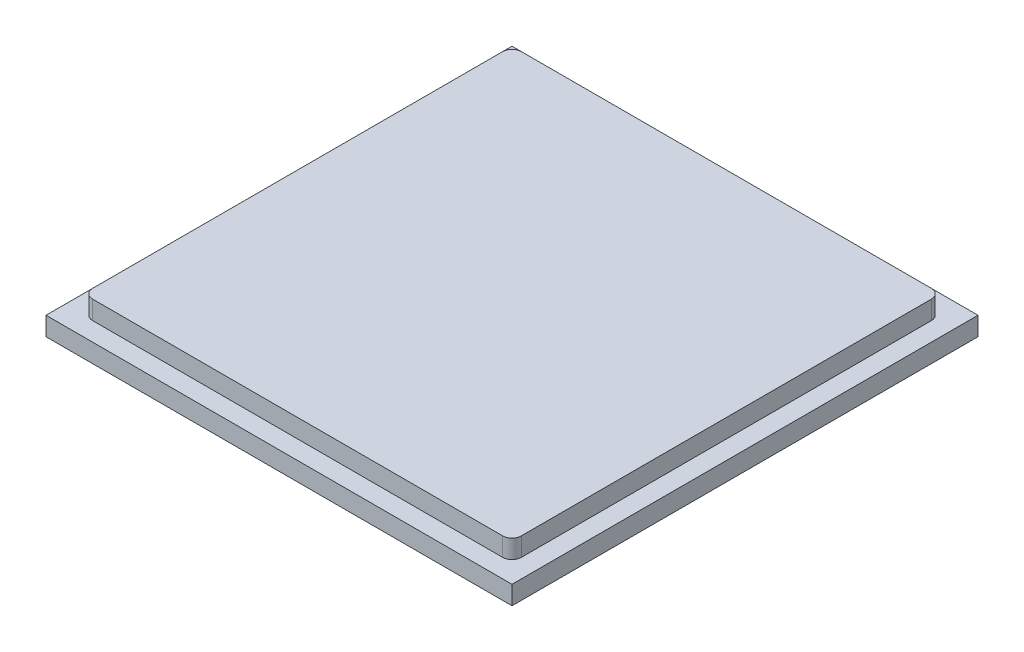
ISO-10303-21;
HEADER;
FILE_DESCRIPTION(('STEP AP214'),'2;1');
FILE_NAME('part.step','',(''),(''),'','','');
FILE_SCHEMA(('AUTOMOTIVE_DESIGN { 1 0 10303 214 1 1 1 1 }'));
ENDSEC;
DATA;
#1=APPLICATION_CONTEXT('core data for automotive mechanical design processes');
#2=APPLICATION_PROTOCOL_DEFINITION('international standard','automotive_design',2000,#1);
#3=PRODUCT_CONTEXT('',#1,'mechanical');
#4=PRODUCT('Part','Part','',(#3));
#5=PRODUCT_RELATED_PRODUCT_CATEGORY('part','',(#4));
#6=PRODUCT_DEFINITION_FORMATION('','',#4);
#7=PRODUCT_DEFINITION_CONTEXT('part definition',#1,'design');
#8=PRODUCT_DEFINITION('design','',#6,#7);
#9=PRODUCT_DEFINITION_SHAPE('','',#8);
#10=(LENGTH_UNIT() NAMED_UNIT(*) SI_UNIT(.MILLI.,.METRE.));
#11=(NAMED_UNIT(*) PLANE_ANGLE_UNIT() SI_UNIT($,.RADIAN.));
#12=(NAMED_UNIT(*) SI_UNIT($,.STERADIAN.) SOLID_ANGLE_UNIT());
#13=UNCERTAINTY_MEASURE_WITH_UNIT(LENGTH_MEASURE(1.E-05),#10,'distance_accuracy_value','');
#14=(GEOMETRIC_REPRESENTATION_CONTEXT(3) GLOBAL_UNCERTAINTY_ASSIGNED_CONTEXT((#13)) GLOBAL_UNIT_ASSIGNED_CONTEXT((#10,
#11,#12)) REPRESENTATION_CONTEXT('',''));
#15=CARTESIAN_POINT('',(0.,0.,0.));
#16=DIRECTION('',(0.,0.,1.));
#17=DIRECTION('',(1.,0.,0.));
#18=AXIS2_PLACEMENT_3D('',#15,#16,#17);
#19=CARTESIAN_POINT('',(0.,2.54,0.));
#20=DIRECTION('',(1.,0.,0.));
#21=DIRECTION('',(0.,0.,-1.));
#22=AXIS2_PLACEMENT_3D('',#19,#20,#21);
#23=PLANE('',#22);
#24=DIRECTION('',(0.,0.,1.));
#25=VECTOR('',#24,1.);
#26=CARTESIAN_POINT('',(0.,0.,0.));
#27=LINE('',#26,#25);
#28=CARTESIAN_POINT('',(0.,0.,-63.5));
#29=VERTEX_POINT('',#28);
#30=CARTESIAN_POINT('',(0.,0.,0.));
#31=VERTEX_POINT('',#30);
#32=EDGE_CURVE('E151',#29,#31,#27,.T.);
#33=ORIENTED_EDGE('',*,*,#32,.T.);
#34=DIRECTION('',(0.,-1.,0.));
#35=VECTOR('',#34,1.);
#36=CARTESIAN_POINT('',(0.,2.54,0.));
#37=LINE('',#36,#35);
#38=CARTESIAN_POINT('',(0.,2.54,0.));
#39=VERTEX_POINT('',#38);
#40=EDGE_CURVE('E11',#39,#31,#37,.T.);
#41=ORIENTED_EDGE('',*,*,#40,.F.);
#42=DIRECTION('',(0.,0.,1.));
#43=VECTOR('',#42,1.);
#44=CARTESIAN_POINT('',(0.,2.54,0.));
#45=LINE('',#44,#43);
#46=CARTESIAN_POINT('',(0.,2.54,-63.5));
#47=VERTEX_POINT('',#46);
#48=EDGE_CURVE('E236',#47,#39,#45,.T.);
#49=ORIENTED_EDGE('',*,*,#48,.F.);
#50=DIRECTION('',(0.,-1.,0.));
#51=VECTOR('',#50,1.);
#52=CARTESIAN_POINT('',(0.,2.54,-63.5));
#53=LINE('',#52,#51);
#54=EDGE_CURVE('E246',#47,#29,#53,.T.);
#55=ORIENTED_EDGE('',*,*,#54,.T.);
#56=EDGE_LOOP('',(#33,#41,#49,#55));
#57=FACE_BOUND('',#56,.T.);
#58=ADVANCED_FACE('F45',(#57),#23,.F.);
#59=CARTESIAN_POINT('',(0.,2.54,0.));
#60=DIRECTION('',(0.,0.,-1.));
#61=DIRECTION('',(-1.,0.,0.));
#62=AXIS2_PLACEMENT_3D('',#59,#60,#61);
#63=PLANE('',#62);
#64=DIRECTION('',(1.,0.,0.));
#65=VECTOR('',#64,1.);
#66=CARTESIAN_POINT('',(0.,0.,0.));
#67=LINE('',#66,#65);
#68=CARTESIAN_POINT('',(63.5,0.,0.));
#69=VERTEX_POINT('',#68);
#70=EDGE_CURVE('E250',#31,#69,#67,.T.);
#71=ORIENTED_EDGE('',*,*,#70,.T.);
#72=DIRECTION('',(0.,-1.,0.));
#73=VECTOR('',#72,1.);
#74=CARTESIAN_POINT('',(63.5,2.54,0.));
#75=LINE('',#74,#73);
#76=CARTESIAN_POINT('',(63.5,2.54,0.));
#77=VERTEX_POINT('',#76);
#78=EDGE_CURVE('E53',#77,#69,#75,.T.);
#79=ORIENTED_EDGE('',*,*,#78,.F.);
#80=DIRECTION('',(1.,0.,0.));
#81=VECTOR('',#80,1.);
#82=CARTESIAN_POINT('',(0.,2.54,0.));
#83=LINE('',#82,#81);
#84=EDGE_CURVE('E97',#39,#77,#83,.T.);
#85=ORIENTED_EDGE('',*,*,#84,.F.);
#86=ORIENTED_EDGE('',*,*,#40,.T.);
#87=EDGE_LOOP('',(#71,#79,#85,#86));
#88=FACE_BOUND('',#87,.T.);
#89=ADVANCED_FACE('F285',(#88),#63,.F.);
#90=CARTESIAN_POINT('',(63.5,2.54,0.));
#91=DIRECTION('',(-1.,0.,0.));
#92=DIRECTION('',(0.,0.,1.));
#93=AXIS2_PLACEMENT_3D('',#90,#91,#92);
#94=PLANE('',#93);
#95=DIRECTION('',(0.,0.,-1.));
#96=VECTOR('',#95,1.);
#97=CARTESIAN_POINT('',(63.5,0.,0.));
#98=LINE('',#97,#96);
#99=CARTESIAN_POINT('',(63.5,0.,-63.5));
#100=VERTEX_POINT('',#99);
#101=EDGE_CURVE('E253',#69,#100,#98,.T.);
#102=ORIENTED_EDGE('',*,*,#101,.T.);
#103=DIRECTION('',(0.,-1.,0.));
#104=VECTOR('',#103,1.);
#105=CARTESIAN_POINT('',(63.5,2.54,-63.5));
#106=LINE('',#105,#104);
#107=CARTESIAN_POINT('',(63.5,2.54,-63.5));
#108=VERTEX_POINT('',#107);
#109=EDGE_CURVE('E260',#108,#100,#106,.T.);
#110=ORIENTED_EDGE('',*,*,#109,.F.);
#111=DIRECTION('',(0.,0.,-1.));
#112=VECTOR('',#111,1.);
#113=CARTESIAN_POINT('',(63.5,2.54,0.));
#114=LINE('',#113,#112);
#115=EDGE_CURVE('E241',#77,#108,#114,.T.);
#116=ORIENTED_EDGE('',*,*,#115,.F.);
#117=ORIENTED_EDGE('',*,*,#78,.T.);
#118=EDGE_LOOP('',(#102,#110,#116,#117));
#119=FACE_BOUND('',#118,.T.);
#120=ADVANCED_FACE('F267',(#119),#94,.F.);
#121=CARTESIAN_POINT('',(0.,2.54,-63.5));
#122=DIRECTION('',(0.,0.,1.));
#123=DIRECTION('',(1.,0.,0.));
#124=AXIS2_PLACEMENT_3D('',#121,#122,#123);
#125=PLANE('',#124);
#126=DIRECTION('',(-1.,0.,0.));
#127=VECTOR('',#126,1.);
#128=CARTESIAN_POINT('',(0.,0.,-63.5));
#129=LINE('',#128,#127);
#130=EDGE_CURVE('E90',#100,#29,#129,.T.);
#131=ORIENTED_EDGE('',*,*,#130,.T.);
#132=ORIENTED_EDGE('',*,*,#54,.F.);
#133=DIRECTION('',(-1.,0.,0.));
#134=VECTOR('',#133,1.);
#135=CARTESIAN_POINT('',(0.,2.54,-63.5));
#136=LINE('',#135,#134);
#137=EDGE_CURVE('E69',#108,#47,#136,.T.);
#138=ORIENTED_EDGE('',*,*,#137,.F.);
#139=ORIENTED_EDGE('',*,*,#109,.T.);
#140=EDGE_LOOP('',(#131,#132,#138,#139));
#141=FACE_BOUND('',#140,.T.);
#142=ADVANCED_FACE('F275',(#141),#125,.F.);
#143=CARTESIAN_POINT('',(0.,2.54,0.));
#144=DIRECTION('',(0.,-1.,0.));
#145=DIRECTION('',(0.,0.,-1.));
#146=AXIS2_PLACEMENT_3D('',#143,#144,#145);
#147=PLANE('',#146);
#148=DIRECTION('',(0.,0.,-1.));
#149=VECTOR('',#148,1.);
#150=CARTESIAN_POINT('',(2.54,2.54,0.));
#151=LINE('',#150,#149);
#152=CARTESIAN_POINT('',(2.54,2.54,-3.81000000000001));
#153=VERTEX_POINT('',#152);
#154=CARTESIAN_POINT('',(2.54,2.54,-59.69));
#155=VERTEX_POINT('',#154);
#156=EDGE_CURVE('E191',#153,#155,#151,.T.);
#157=ORIENTED_EDGE('',*,*,#156,.T.);
#158=CARTESIAN_POINT('',(3.81,2.54,-59.69));
#159=DIRECTION('',(0.,1.,0.));
#160=DIRECTION('',(0.,0.,1.));
#161=AXIS2_PLACEMENT_3D('',#158,#159,#160);
#162=CIRCLE('',#161,1.27);
#163=CARTESIAN_POINT('',(3.81000000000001,2.54,-60.96));
#164=VERTEX_POINT('',#163);
#165=EDGE_CURVE('E60',#155,#164,#162,.F.);
#166=ORIENTED_EDGE('',*,*,#165,.T.);
#167=DIRECTION('',(1.,0.,0.));
#168=VECTOR('',#167,1.);
#169=CARTESIAN_POINT('',(0.,2.54,-60.96));
#170=LINE('',#169,#168);
#171=CARTESIAN_POINT('',(59.69,2.54,-60.96));
#172=VERTEX_POINT('',#171);
#173=EDGE_CURVE('E164',#164,#172,#170,.T.);
#174=ORIENTED_EDGE('',*,*,#173,.T.);
#175=CARTESIAN_POINT('',(59.69,2.54,-59.69));
#176=DIRECTION('',(0.,1.,0.));
#177=DIRECTION('',(0.,0.,1.));
#178=AXIS2_PLACEMENT_3D('',#175,#176,#177);
#179=CIRCLE('',#178,1.27);
#180=CARTESIAN_POINT('',(60.96,2.54,-59.69));
#181=VERTEX_POINT('',#180);
#182=EDGE_CURVE('E208',#172,#181,#179,.F.);
#183=ORIENTED_EDGE('',*,*,#182,.T.);
#184=DIRECTION('',(0.,0.,-1.));
#185=VECTOR('',#184,1.);
#186=CARTESIAN_POINT('',(60.96,2.54,0.));
#187=LINE('',#186,#185);
#188=CARTESIAN_POINT('',(60.96,2.54,-3.81000000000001));
#189=VERTEX_POINT('',#188);
#190=EDGE_CURVE('E204',#189,#181,#187,.T.);
#191=ORIENTED_EDGE('',*,*,#190,.F.);
#192=CARTESIAN_POINT('',(59.69,2.54,-3.81));
#193=DIRECTION('',(0.,1.,0.));
#194=DIRECTION('',(0.,0.,1.));
#195=AXIS2_PLACEMENT_3D('',#192,#193,#194);
#196=CIRCLE('',#195,1.27);
#197=CARTESIAN_POINT('',(59.69,2.54,-2.54));
#198=VERTEX_POINT('',#197);
#199=EDGE_CURVE('E201',#198,#189,#196,.T.);
#200=ORIENTED_EDGE('',*,*,#199,.F.);
#201=DIRECTION('',(1.,0.,0.));
#202=VECTOR('',#201,1.);
#203=CARTESIAN_POINT('',(0.,2.54,-2.54));
#204=LINE('',#203,#202);
#205=CARTESIAN_POINT('',(3.81000000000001,2.54,-2.54));
#206=VERTEX_POINT('',#205);
#207=EDGE_CURVE('E198',#206,#198,#204,.T.);
#208=ORIENTED_EDGE('',*,*,#207,.F.);
#209=CARTESIAN_POINT('',(3.81,2.54,-3.81));
#210=DIRECTION('',(0.,1.,0.));
#211=DIRECTION('',(0.,0.,1.));
#212=AXIS2_PLACEMENT_3D('',#209,#210,#211);
#213=CIRCLE('',#212,1.27);
#214=EDGE_CURVE('E194',#206,#153,#213,.F.);
#215=ORIENTED_EDGE('',*,*,#214,.T.);
#216=EDGE_LOOP('',(#157,#166,#174,#183,#191,#200,#208,#215));
#217=FACE_BOUND('',#216,.T.);
#218=ORIENTED_EDGE('',*,*,#48,.T.);
#219=ORIENTED_EDGE('',*,*,#84,.T.);
#220=ORIENTED_EDGE('',*,*,#115,.T.);
#221=ORIENTED_EDGE('',*,*,#137,.T.);
#222=EDGE_LOOP('',(#218,#219,#220,#221));
#223=FACE_BOUND('',#222,.T.);
#224=ADVANCED_FACE('F277',(#217,#223),#147,.F.);
#225=CARTESIAN_POINT('',(0.,0.,0.));
#226=DIRECTION('',(0.,-1.,0.));
#227=DIRECTION('',(0.,0.,-1.));
#228=AXIS2_PLACEMENT_3D('',#225,#226,#227);
#229=PLANE('',#228);
#230=ORIENTED_EDGE('',*,*,#32,.F.);
#231=ORIENTED_EDGE('',*,*,#130,.F.);
#232=ORIENTED_EDGE('',*,*,#101,.F.);
#233=ORIENTED_EDGE('',*,*,#70,.F.);
#234=EDGE_LOOP('',(#230,#231,#232,#233));
#235=FACE_BOUND('',#234,.T.);
#236=ADVANCED_FACE('F271',(#235),#229,.T.);
#237=CARTESIAN_POINT('',(3.81,5.08,-59.69));
#238=DIRECTION('',(0.,-1.,0.));
#239=DIRECTION('',(0.,0.,-1.));
#240=AXIS2_PLACEMENT_3D('',#237,#238,#239);
#241=CYLINDRICAL_SURFACE('',#240,1.27);
#242=ORIENTED_EDGE('',*,*,#165,.F.);
#243=DIRECTION('',(0.,-1.,0.));
#244=VECTOR('',#243,1.);
#245=CARTESIAN_POINT('',(2.54,5.08,-59.69));
#246=LINE('',#245,#244);
#247=CARTESIAN_POINT('',(2.54,5.08,-59.69));
#248=VERTEX_POINT('',#247);
#249=EDGE_CURVE('E141',#248,#155,#246,.T.);
#250=ORIENTED_EDGE('',*,*,#249,.F.);
#251=CARTESIAN_POINT('',(3.81,5.08,-59.69));
#252=DIRECTION('',(0.,1.,0.));
#253=DIRECTION('',(0.,0.,1.));
#254=AXIS2_PLACEMENT_3D('',#251,#252,#253);
#255=CIRCLE('',#254,1.27);
#256=CARTESIAN_POINT('',(3.81000000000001,5.08,-60.96));
#257=VERTEX_POINT('',#256);
#258=EDGE_CURVE('E144',#248,#257,#255,.F.);
#259=ORIENTED_EDGE('',*,*,#258,.T.);
#260=DIRECTION('',(0.,-1.,0.));
#261=VECTOR('',#260,1.);
#262=CARTESIAN_POINT('',(3.81000000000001,5.08,-60.96));
#263=LINE('',#262,#261);
#264=EDGE_CURVE('E188',#257,#164,#263,.T.);
#265=ORIENTED_EDGE('',*,*,#264,.T.);
#266=EDGE_LOOP('',(#242,#250,#259,#265));
#267=FACE_BOUND('',#266,.T.);
#268=ADVANCED_FACE('F143',(#267),#241,.T.);
#269=CARTESIAN_POINT('',(2.54,5.08,0.));
#270=DIRECTION('',(-1.,0.,0.));
#271=DIRECTION('',(0.,0.,1.));
#272=AXIS2_PLACEMENT_3D('',#269,#270,#271);
#273=PLANE('',#272);
#274=ORIENTED_EDGE('',*,*,#156,.F.);
#275=DIRECTION('',(0.,-1.,0.));
#276=VECTOR('',#275,1.);
#277=CARTESIAN_POINT('',(2.54,5.08,-3.81000000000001));
#278=LINE('',#277,#276);
#279=CARTESIAN_POINT('',(2.54,5.08,-3.81000000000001));
#280=VERTEX_POINT('',#279);
#281=EDGE_CURVE('E152',#280,#153,#278,.T.);
#282=ORIENTED_EDGE('',*,*,#281,.F.);
#283=DIRECTION('',(0.,0.,-1.));
#284=VECTOR('',#283,1.);
#285=CARTESIAN_POINT('',(2.54,5.08,0.));
#286=LINE('',#285,#284);
#287=EDGE_CURVE('E158',#280,#248,#286,.T.);
#288=ORIENTED_EDGE('',*,*,#287,.T.);
#289=ORIENTED_EDGE('',*,*,#249,.T.);
#290=EDGE_LOOP('',(#274,#282,#288,#289));
#291=FACE_BOUND('',#290,.T.);
#292=ADVANCED_FACE('F166',(#291),#273,.T.);
#293=CARTESIAN_POINT('',(3.81,5.08,-3.81));
#294=DIRECTION('',(0.,-1.,0.));
#295=DIRECTION('',(0.,0.,-1.));
#296=AXIS2_PLACEMENT_3D('',#293,#294,#295);
#297=CYLINDRICAL_SURFACE('',#296,1.27);
#298=ORIENTED_EDGE('',*,*,#214,.F.);
#299=DIRECTION('',(0.,-1.,0.));
#300=VECTOR('',#299,1.);
#301=CARTESIAN_POINT('',(3.81000000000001,5.08,-2.54));
#302=LINE('',#301,#300);
#303=CARTESIAN_POINT('',(3.81000000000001,5.08,-2.54));
#304=VERTEX_POINT('',#303);
#305=EDGE_CURVE('E231',#304,#206,#302,.T.);
#306=ORIENTED_EDGE('',*,*,#305,.F.);
#307=CARTESIAN_POINT('',(3.81,5.08,-3.81));
#308=DIRECTION('',(0.,1.,0.));
#309=DIRECTION('',(0.,0.,1.));
#310=AXIS2_PLACEMENT_3D('',#307,#308,#309);
#311=CIRCLE('',#310,1.27);
#312=EDGE_CURVE('E168',#304,#280,#311,.F.);
#313=ORIENTED_EDGE('',*,*,#312,.T.);
#314=ORIENTED_EDGE('',*,*,#281,.T.);
#315=EDGE_LOOP('',(#298,#306,#313,#314));
#316=FACE_BOUND('',#315,.T.);
#317=ADVANCED_FACE('F337',(#316),#297,.T.);
#318=CARTESIAN_POINT('',(0.,5.08,-2.54));
#319=DIRECTION('',(0.,0.,-1.));
#320=DIRECTION('',(-1.,0.,0.));
#321=AXIS2_PLACEMENT_3D('',#318,#319,#320);
#322=PLANE('',#321);
#323=ORIENTED_EDGE('',*,*,#207,.T.);
#324=DIRECTION('',(0.,-1.,0.));
#325=VECTOR('',#324,1.);
#326=CARTESIAN_POINT('',(59.69,5.08,-2.54));
#327=LINE('',#326,#325);
#328=CARTESIAN_POINT('',(59.69,5.08,-2.54));
#329=VERTEX_POINT('',#328);
#330=EDGE_CURVE('E227',#329,#198,#327,.T.);
#331=ORIENTED_EDGE('',*,*,#330,.F.);
#332=DIRECTION('',(1.,0.,0.));
#333=VECTOR('',#332,1.);
#334=CARTESIAN_POINT('',(0.,5.08,-2.54));
#335=LINE('',#334,#333);
#336=EDGE_CURVE('E171',#304,#329,#335,.T.);
#337=ORIENTED_EDGE('',*,*,#336,.F.);
#338=ORIENTED_EDGE('',*,*,#305,.T.);
#339=EDGE_LOOP('',(#323,#331,#337,#338));
#340=FACE_BOUND('',#339,.T.);
#341=ADVANCED_FACE('F347',(#340),#322,.F.);
#342=CARTESIAN_POINT('',(59.69,5.08,-3.81));
#343=DIRECTION('',(0.,-1.,0.));
#344=DIRECTION('',(0.,0.,-1.));
#345=AXIS2_PLACEMENT_3D('',#342,#343,#344);
#346=CYLINDRICAL_SURFACE('',#345,1.27);
#347=ORIENTED_EDGE('',*,*,#199,.T.);
#348=DIRECTION('',(0.,-1.,0.));
#349=VECTOR('',#348,1.);
#350=CARTESIAN_POINT('',(60.96,5.08,-3.81000000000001));
#351=LINE('',#350,#349);
#352=CARTESIAN_POINT('',(60.96,5.08,-3.81000000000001));
#353=VERTEX_POINT('',#352);
#354=EDGE_CURVE('E223',#353,#189,#351,.T.);
#355=ORIENTED_EDGE('',*,*,#354,.F.);
#356=CARTESIAN_POINT('',(59.69,5.08,-3.81));
#357=DIRECTION('',(0.,1.,0.));
#358=DIRECTION('',(0.,0.,1.));
#359=AXIS2_PLACEMENT_3D('',#356,#357,#358);
#360=CIRCLE('',#359,1.27);
#361=EDGE_CURVE('E176',#329,#353,#360,.T.);
#362=ORIENTED_EDGE('',*,*,#361,.F.);
#363=ORIENTED_EDGE('',*,*,#330,.T.);
#364=EDGE_LOOP('',(#347,#355,#362,#363));
#365=FACE_BOUND('',#364,.T.);
#366=ADVANCED_FACE('F358',(#365),#346,.T.);
#367=CARTESIAN_POINT('',(60.96,5.08,0.));
#368=DIRECTION('',(-1.,0.,0.));
#369=DIRECTION('',(0.,0.,1.));
#370=AXIS2_PLACEMENT_3D('',#367,#368,#369);
#371=PLANE('',#370);
#372=ORIENTED_EDGE('',*,*,#190,.T.);
#373=DIRECTION('',(0.,-1.,0.));
#374=VECTOR('',#373,1.);
#375=CARTESIAN_POINT('',(60.96,5.08,-59.69));
#376=LINE('',#375,#374);
#377=CARTESIAN_POINT('',(60.96,5.08,-59.69));
#378=VERTEX_POINT('',#377);
#379=EDGE_CURVE('E220',#378,#181,#376,.T.);
#380=ORIENTED_EDGE('',*,*,#379,.F.);
#381=DIRECTION('',(0.,0.,-1.));
#382=VECTOR('',#381,1.);
#383=CARTESIAN_POINT('',(60.96,5.08,0.));
#384=LINE('',#383,#382);
#385=EDGE_CURVE('E179',#353,#378,#384,.T.);
#386=ORIENTED_EDGE('',*,*,#385,.F.);
#387=ORIENTED_EDGE('',*,*,#354,.T.);
#388=EDGE_LOOP('',(#372,#380,#386,#387));
#389=FACE_BOUND('',#388,.T.);
#390=ADVANCED_FACE('F369',(#389),#371,.F.);
#391=CARTESIAN_POINT('',(59.69,5.08,-59.69));
#392=DIRECTION('',(0.,-1.,0.));
#393=DIRECTION('',(0.,0.,-1.));
#394=AXIS2_PLACEMENT_3D('',#391,#392,#393);
#395=CYLINDRICAL_SURFACE('',#394,1.27);
#396=ORIENTED_EDGE('',*,*,#182,.F.);
#397=DIRECTION('',(0.,-1.,0.));
#398=VECTOR('',#397,1.);
#399=CARTESIAN_POINT('',(59.69,5.08,-60.96));
#400=LINE('',#399,#398);
#401=CARTESIAN_POINT('',(59.69,5.08,-60.96));
#402=VERTEX_POINT('',#401);
#403=EDGE_CURVE('E217',#402,#172,#400,.T.);
#404=ORIENTED_EDGE('',*,*,#403,.F.);
#405=CARTESIAN_POINT('',(59.69,5.08,-59.69));
#406=DIRECTION('',(0.,1.,0.));
#407=DIRECTION('',(0.,0.,1.));
#408=AXIS2_PLACEMENT_3D('',#405,#406,#407);
#409=CIRCLE('',#408,1.27);
#410=EDGE_CURVE('E182',#402,#378,#409,.F.);
#411=ORIENTED_EDGE('',*,*,#410,.T.);
#412=ORIENTED_EDGE('',*,*,#379,.T.);
#413=EDGE_LOOP('',(#396,#404,#411,#412));
#414=FACE_BOUND('',#413,.T.);
#415=ADVANCED_FACE('F380',(#414),#395,.T.);
#416=CARTESIAN_POINT('',(0.,5.08,-60.96));
#417=DIRECTION('',(0.,0.,-1.));
#418=DIRECTION('',(-1.,0.,0.));
#419=AXIS2_PLACEMENT_3D('',#416,#417,#418);
#420=PLANE('',#419);
#421=ORIENTED_EDGE('',*,*,#173,.F.);
#422=ORIENTED_EDGE('',*,*,#264,.F.);
#423=DIRECTION('',(1.,0.,0.));
#424=VECTOR('',#423,1.);
#425=CARTESIAN_POINT('',(0.,5.08,-60.96));
#426=LINE('',#425,#424);
#427=EDGE_CURVE('E162',#257,#402,#426,.T.);
#428=ORIENTED_EDGE('',*,*,#427,.T.);
#429=ORIENTED_EDGE('',*,*,#403,.T.);
#430=EDGE_LOOP('',(#421,#422,#428,#429));
#431=FACE_BOUND('',#430,.T.);
#432=ADVANCED_FACE('F391',(#431),#420,.T.);
#433=CARTESIAN_POINT('',(0.,5.08,0.));
#434=DIRECTION('',(0.,1.,0.));
#435=DIRECTION('',(0.,0.,1.));
#436=AXIS2_PLACEMENT_3D('',#433,#434,#435);
#437=PLANE('',#436);
#438=ORIENTED_EDGE('',*,*,#258,.F.);
#439=ORIENTED_EDGE('',*,*,#287,.F.);
#440=ORIENTED_EDGE('',*,*,#312,.F.);
#441=ORIENTED_EDGE('',*,*,#336,.T.);
#442=ORIENTED_EDGE('',*,*,#361,.T.);
#443=ORIENTED_EDGE('',*,*,#385,.T.);
#444=ORIENTED_EDGE('',*,*,#410,.F.);
#445=ORIENTED_EDGE('',*,*,#427,.F.);
#446=EDGE_LOOP('',(#438,#439,#440,#441,#442,#443,#444,#445));
#447=FACE_BOUND('',#446,.T.);
#448=ADVANCED_FACE('F156',(#447),#437,.T.);
#449=CLOSED_SHELL('',(#58,#89,#120,#142,#224,#236,#268,#292,#317,#341,#366,#390,#415,#432,#448));
#450=MANIFOLD_SOLID_BREP('B2',#449);
#451=ADVANCED_BREP_SHAPE_REPRESENTATION('',(#18,#450),#14);
#452=SHAPE_DEFINITION_REPRESENTATION(#9,#451);
ENDSEC;
END-ISO-10303-21;
